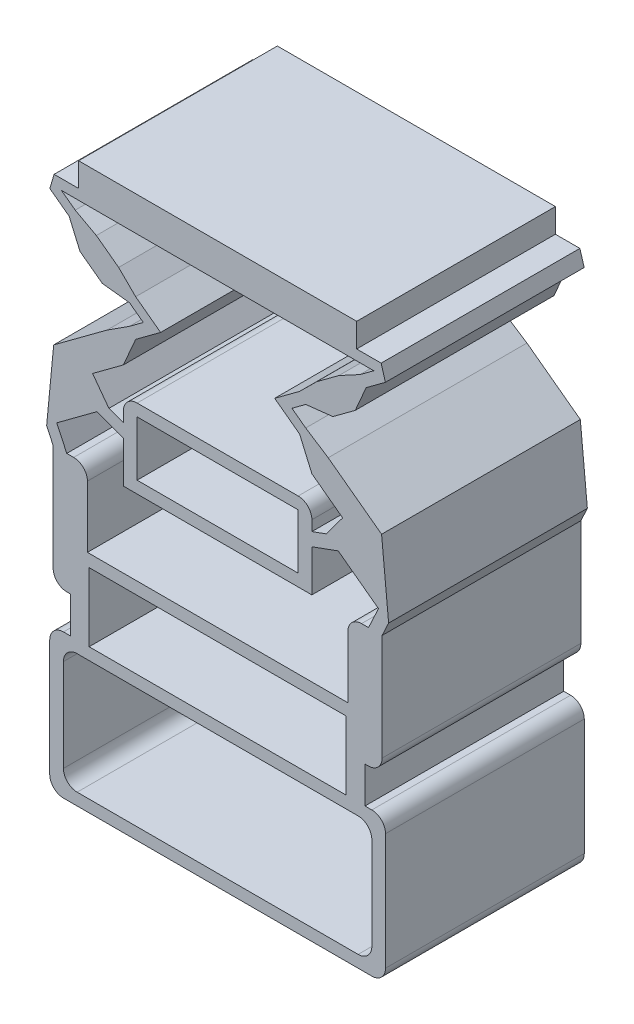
from build123d import *

# Parameters (mm, degrees)
EXTRUDE_1_DEPTH     = 5.8
SKETCH_10_W         = 7.5
SKETCH_10_H         = 2
SKETCH_10_W_2       = 4.7
SKETCH_10_H_2       = 1.6
CUT_EXTRUDE_3_DEPTH = 11.452014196
EXTRUDE_2_DEPTH     = 5.8
FILLET_1_R          = 0.4
CUT_EXTRUDE_4_DEPTH = 11.452014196
SKETCH_14_W         = 7.5
SKETCH_14_H         = 0.01
SKETCH_14_W_2       = 7.6
EXTRUDE_4_DEPTH     = 5.8
SKETCH_15_W         = 7.5
SKETCH_15_H         = 0.01
CUT_EXTRUDE_5_DEPTH = 10.993639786
EXTRUDE_3_DEPTH     = 5.8
SKETCH_16_W         = 9.8
SKETCH_16_H         = 4.2
SKETCH_16_W_2       = 9
SKETCH_16_H_2       = 3.5
EXTRUDE_5_DEPTH     = 5.8
FILLET_2_R          = 0.4
FILLET_3_R          = 0.4
SKETCH_17_W         = 9.301217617
SKETCH_17_H         = 3.929340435
EXTRUDE_6_DEPTH     = 0.3
SKETCH_18_W         = 0.5
SKETCH_18_H         = 1.06
EXTRUDE_7_DEPTH     = 5.8


with BuildPart() as part:
    # Sketch 1 → Extrude 1 (new body)
    with BuildSketch(Plane.XY):
        Polygon((2.75, 5.15), (3.172861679, 5.303909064), (4.006144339, 6.428915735), (5.854369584, 5.059951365), (5.021086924, 3.934944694), (4.990178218, 3.957838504), (4.8, 3.55), (4.8, 0.05), (3.8, 0.05), (3.8, -1.35), (-3.8, -1.35), (-3.8, 1.35), (3.8, 1.35), (3.8, 3.55), (4.402783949, 3.55), (4.694935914, 4.176521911), (3.519668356, 5.047032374), (2.75, 4.766896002), (2.75, 3.55), (-2.75, 3.55), (-2.75, 5.15), align=None)
    extrude_1 = extrude(amount=EXTRUDE_1_DEPTH)

    # Mirror 1: Extrude 1 across plane
    add(extrude_1.mirror(Plane(origin=(0, 0, 0), x_dir=(0, 0, 1), z_dir=(1, 0, 0))))

    # Sketch 10 → Cut-Extrude 3 (cut, through all)
    with BuildSketch(Plane.XY.offset(5.8)):
        Rectangle(SKETCH_10_W, SKETCH_10_H)
        with Locations((0, 4.7)):
            Rectangle(SKETCH_10_W_2, SKETCH_10_H_2)
    extrude(amount=-CUT_EXTRUDE_3_DEPTH, mode=Mode.SUBTRACT)

    # Sketch 11 → Extrude 2 (add)
    with BuildSketch(Plane.XY.offset(5.8)):
        Polygon((-2.35, 5.15), (-2.75, 5.15), (-2.75, 5.85), (2.75, 5.85), (2.75, 5.15), (2.35, 5.15), (2.35, 5.5), (-2.35, 5.5), align=None)
    extrude(amount=-EXTRUDE_2_DEPTH)

    # Fillet 1
    fillet_1_edges = [part.edges().sort_by_distance(p)[0] for p in [
        (2.75, 5.85, 2.9),
        (-2.75, 5.85, 2.9),
    ]]
    fillet(fillet_1_edges, radius=FILLET_1_R)

    # Sketch 13 → Cut-Extrude 4 (cut, through all)
    with BuildSketch(Plane.XY.offset(5.8)):
        Polygon((-4.990178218, 3.957838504), (-4.810500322, 5.833136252), (-5.854369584, 5.059951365), (-5.021086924, 3.934944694), align=None)
        Polygon((4.990178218, 3.957838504), (5.021086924, 3.934944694), (5.854369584, 5.059951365), (4.810500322, 5.833136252), align=None)
    extrude(amount=-CUT_EXTRUDE_4_DEPTH, mode=Mode.SUBTRACT)

    # Sketch 14 → Extrude 4 (add)
    with BuildSketch(Plane.XY.offset(5.8)):
        with Locations((0, 0.995)):
            Rectangle(SKETCH_14_W, SKETCH_14_H)
        with Locations((0, -1.355)):
            Rectangle(SKETCH_14_W_2, SKETCH_14_H)
    extrude(amount=-EXTRUDE_4_DEPTH)

    # Sketch 15 → Cut-Extrude 5 (cut, through all)
    with BuildSketch(Plane.XY.offset(5.8)):
        with Locations((0, -1.005)):
            Rectangle(SKETCH_15_W, SKETCH_15_H)
    extrude(amount=-CUT_EXTRUDE_5_DEPTH, mode=Mode.SUBTRACT)

    # Sketch 12 → Extrude 3 (add)
    with BuildSketch(Plane.XY.offset(5.8)):
        Polygon((-2.570649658, 7.678839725), (-2.168861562, 7.976440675), (-2.570649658, 8.274041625), (-3.365464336, 8.36497912), (-4.015824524, 8.846695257), (-4.334477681, 9.580493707), (-4.896981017, 9.997135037), (-4.771752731, 10.419167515), (-4.057705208, 10.419167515), (-4.057705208, 11.119167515), (4.057705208, 11.119167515), (4.057705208, 10.419167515), (4.771752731, 10.419167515), (4.896981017, 9.997135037), (4.334477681, 9.580493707), (4.015824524, 8.846695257), (3.365464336, 8.36497912), (2.570649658, 8.274041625), (2.168861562, 7.976440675), (2.570649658, 7.678839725), (3.226735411, 7.255104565), (4.784832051, 6.10103593), (4.810500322, 5.833136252), (4.006144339, 6.428915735), (3.649023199, 5.946770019), (2.750573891, 6.612243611), (2.392089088, 7.437766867), (1.664830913, 7.976440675), (2.392089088, 8.515114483), (2.889302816, 9.007840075), (3.539663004, 9.489556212), (4.155917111, 9.821566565), (4.557705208, 10.119167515), (4.057705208, 10.119167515), (-4.057705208, 10.119167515), (-4.557705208, 10.119167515), (-4.155917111, 9.821566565), (-3.539663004, 9.489556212), (-2.889302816, 9.007840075), (-2.392089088, 8.515114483), (-1.664830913, 7.976440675), (-2.392089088, 7.437766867), (-2.750573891, 6.612243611), (-3.649023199, 5.946770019), (-4.006144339, 6.428915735), (-4.810500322, 5.833136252), (-4.784832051, 6.10103593), (-3.226735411, 7.255104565), align=None)
    extrude(amount=-EXTRUDE_3_DEPTH)

    # Sketch 16 → Extrude 5 (add)
    with BuildSketch(Plane.XY.offset(5.8)):
        with Locations((0, -3.11)):
            Rectangle(SKETCH_16_W, SKETCH_16_H)
        with Locations((0, -3.11)):
            Rectangle(SKETCH_16_W_2, SKETCH_16_H_2, mode=Mode.SUBTRACT)
    extrude(amount=-EXTRUDE_5_DEPTH)

    # Fillet 2
    fillet_2_edges = [part.edges().sort_by_distance(p)[0] for p in [
        (4.8, 0.05, 2.9),
        (4.5, -1.36, 2.9),
        (-4.9, -1.01, 2.9),
        (-4.9, -5.21, 2.9),
        (4.9, -1.01, 2.9),
        (4.9, -5.21, 2.9),
        (-4.5, -1.36, 2.9),
        (4.5, -4.86, 2.9),
        (-4.5, -4.86, 2.9),
        (-4.8, 0.05, 2.9),
    ]]
    fillet(fillet_2_edges, radius=FILLET_2_R)

    # Fillet 3
    fillet_3_edges = [part.edges().sort_by_distance(p)[0] for p in [
        (3.8, 3.55, 2.9),
        (-3.8, 3.55, 2.9),
    ]]
    fillet(fillet_3_edges, radius=FILLET_3_R)

    # Sketch 17 → Extrude 6 (add)
    with BuildSketch(Plane(origin=(0, 0, 0), x_dir=(-1, 0, 0), z_dir=(0, 0, -1))):
        with Locations((0.005385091, -3.162980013)):
            Rectangle(SKETCH_17_W, SKETCH_17_H)
    extrude(amount=-EXTRUDE_6_DEPTH)

    # Sketch 18 → Extrude 7 (add)
    with BuildSketch(Plane.XY.offset(5.8)):
        with Locations((-4.05, -0.48)):
            Rectangle(SKETCH_18_W, SKETCH_18_H)
        with Locations((4.05, -0.48)):
            Rectangle(SKETCH_18_W, SKETCH_18_H)
    extrude(amount=-EXTRUDE_7_DEPTH)


solid = part.part
